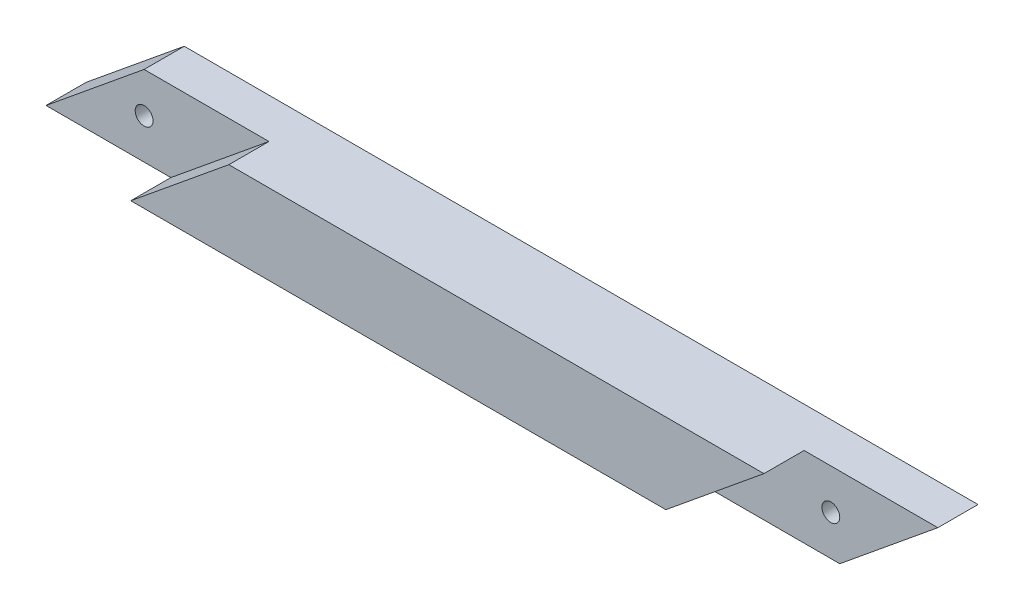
from build123d import *

# Parameters (mm, degrees)
ESQUISSE1_W             = 100
ESQUISSE1_H             = 9
EXTRUSION1_DEPTH        = 9
ENL_V_MAT_EXTRU_4_DEPTH = 9
ENL_V_MAT_EXTRU_5_DEPTH = 4.5
ESQUISSE6_R             = 1
ENL_V_MAT_EXTRU_6_DEPTH = 4.5
ENL_V_MAT_EXTRU_7_DEPTH = 9
ENL_V_MAT_EXTRU_8_DEPTH = 4.5
ESQUISSE9_R             = 1
ENL_V_MAT_EXTRU_9_DEPTH = 4.5


with BuildPart() as part:
    # Esquisse1 → Extrusion1 (new body)
    with BuildSketch(Plane.XY):
        with Locations((50, 4.5)):
            Rectangle(ESQUISSE1_W, ESQUISSE1_H)
    extrude(amount=EXTRUSION1_DEPTH)

    # Esquisse2 → Enl_v. mat.-Extru.4 (cut)
    with BuildSketch(Plane.XY.offset(9)):
        Polygon((0, 9), (0, 0), (11, 9), align=None)
    extrude(amount=-ENL_V_MAT_EXTRU_4_DEPTH, mode=Mode.SUBTRACT)

    # Esquisse5 → Enl_v. mat.-Extru.5 (cut)
    with BuildSketch(Plane.XY.offset(9)):
        Polygon((11, 9), (25, 9), (14, 0), (0, 0), align=None)
    extrude(amount=-ENL_V_MAT_EXTRU_5_DEPTH, mode=Mode.SUBTRACT)

    # Esquisse6 → Enl_v. mat.-Extru.6 (cut)
    with BuildSketch(Plane.XY.offset(4.5)):
        with Locations((11, 4.5)):
            Circle(ESQUISSE6_R)
    extrude(amount=-ENL_V_MAT_EXTRU_6_DEPTH, mode=Mode.SUBTRACT)

    # Esquisse7 → Enl_v. mat.-Extru.7 (cut)
    with BuildSketch(Plane.XY.offset(9)):
        Polygon((100, 9), (89, 0), (100, 0), align=None)
    extrude(amount=-ENL_V_MAT_EXTRU_7_DEPTH, mode=Mode.SUBTRACT)

    # Esquisse8 → Enl_v. mat.-Extru.8 (cut)
    with BuildSketch(Plane.XY.offset(9)):
        Polygon((100, 9), (85, 9), (74, 0), (89, 0), align=None)
    extrude(amount=-ENL_V_MAT_EXTRU_8_DEPTH, mode=Mode.SUBTRACT)

    # Esquisse9 → Enl_v. mat.-Extru.9 (cut)
    with BuildSketch(Plane.XY.offset(4.5)):
        with Locations((88, 4.5)):
            Circle(ESQUISSE9_R)
    extrude(amount=-ENL_V_MAT_EXTRU_9_DEPTH, mode=Mode.SUBTRACT)


solid = part.part
